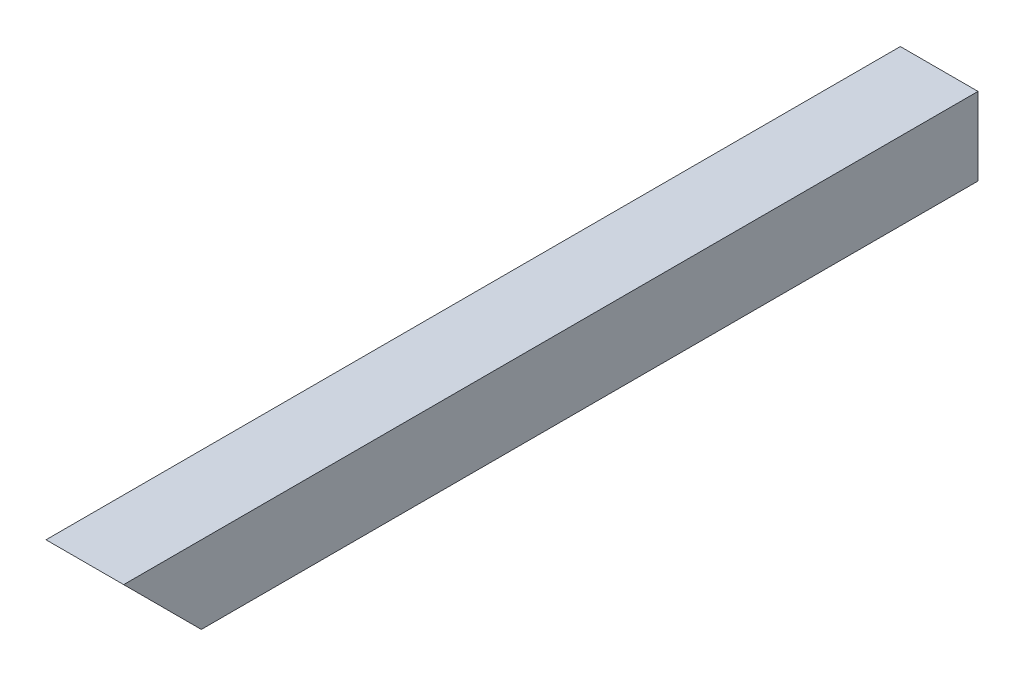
from build123d import *

# Parameters (mm, degrees)
SCHIZZO1_W                = 30
SCHIZZO1_H                = 30
SCHIZZO1_W_2              = 26
SCHIZZO1_H_2              = 26
ESTRUSIONE_SOTTILE1_DEPTH = 330
TAGLIO_ESTRUSIONE1_REACH  = 333.7


with BuildPart() as part:
    # Schizzo1 → Estrusione-Sottile1 (new body)
    with BuildSketch(Plane.XY):
        Rectangle(SCHIZZO1_W, SCHIZZO1_H)
        Rectangle(SCHIZZO1_W_2, SCHIZZO1_H_2, mode=Mode.SUBTRACT)
    extrude(amount=ESTRUSIONE_SOTTILE1_DEPTH)

    # Schizzo2 → Taglio-Estrusione1 (cut, up to next)
    with BuildSketch(Plane(origin=(15, 0, 0), x_dir=(0, 0, -1), z_dir=(1, 0, 0)), mode=Mode.PRIVATE) as taglio_estrusione1_sk1:
        Polygon((-330, 15), (-300, -15), (-330, -15), align=None)
    taglio_estrusione1_tool1 = extrude(taglio_estrusione1_sk1.sketch, amount=-TAGLIO_ESTRUSIONE1_REACH, mode=Mode.PRIVATE) & part.part
    add(taglio_estrusione1_tool1.solids().sort_by_distance((15, -5, 320))[0], mode=Mode.SUBTRACT)


solid = part.part
